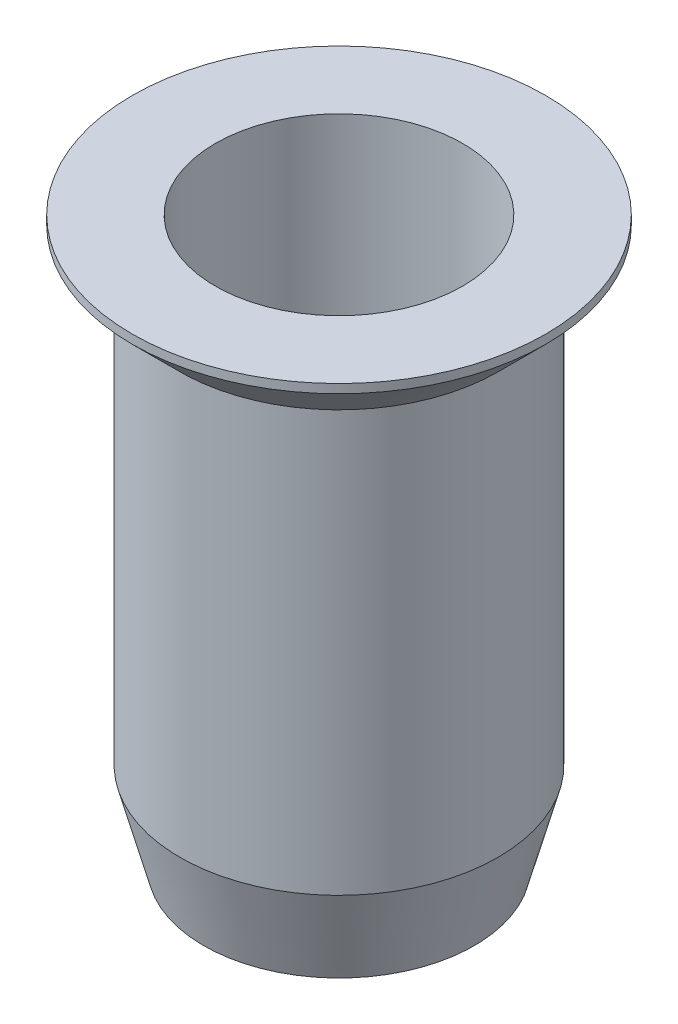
from build123d import *


with BuildPart() as part:
    # Esquisse1 → R_volution1 (revolve)
    with BuildSketch(Plane.XY, mode=Mode.PRIVATE) as r_volution1_sk:
        Polygon((3.5, 0), (5.85, 0), (5.85, -0.25), (4.5, -1.6), (4.5, -13.5), (3.830127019, -16), (3, -16), (3, -7.288675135), (3.5, -7), align=None)
    revolve(r_volution1_sk.sketch.rotate(Axis((0, 0, 0), (0, -1, 0)), 180), axis=Axis((0, 0, 0), (0, -1, 0)))


solid = part.part
